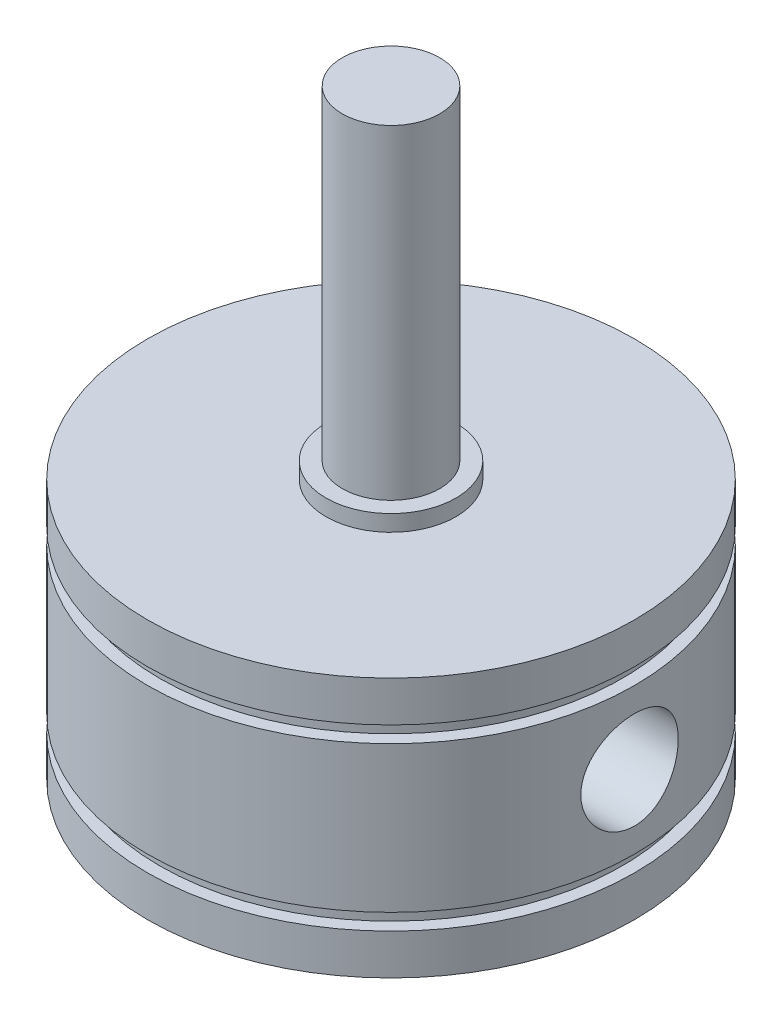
from build123d import *

# Parameters (mm, degrees)
ESBO_O4_R                = 3
FURO_PERPENDICULAR_DEPTH = 53.971690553
ESBO_O5_R                = 3


with BuildPart() as part:
    # Esbo_o2 → Revolu_o (revolve)
    with BuildSketch(Plane.XY, mode=Mode.PRIVATE) as revolu_o_sk:
        Polygon((0, 0), (0, 41), (3, 41), (3, 21), (4, 21), (4, 20), (15, 20), (15, 17.5), (14.25, 17.5), (14.25, 16.5), (15, 16.5), (15, 7.5), (14.25, 7.5), (14.25, 6.5), (15, 6.5), (15, 4), (4, 4), (4, 3), (3, 3), (3, 0), align=None)
    revolve(revolu_o_sk.sketch.rotate(Axis((0, 52.88343403, 0), (0, -1, 0)), 90), axis=Axis((0, 52.88343403, 0), (0, -1, 0)))

    # Esbo_o4 → Furo perpendicular (cut, through all)
    with BuildSketch(Plane.ZY.offset(15)):
        with Locations((0, 12)):
            Circle(ESBO_O4_R)
    extrude(amount=-FURO_PERPENDICULAR_DEPTH, mode=Mode.SUBTRACT)

    # Furo desviado a 25 graus: sweep along a path in Esbo_o7
    with BuildLine(Plane(origin=(0, 12, 0), x_dir=(1, 0, 0), z_dir=(0, 1, 0))) as furo_desviado_a_25_graus_path:
        Line((-13.594616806, -6.339273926), (0, 0))
    # Esbo_o5 → Furo desviado a 25 graus (sweep, cut)
    with BuildSketch(Plane(origin=(-13.594616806, 0, 6.339273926), x_dir=(0, 1, 0), z_dir=(-0.9063077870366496, 0, 0.4226182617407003))):
        with Locations((12, 0)):
            Circle(ESBO_O5_R)
    sweep(path=furo_desviado_a_25_graus_path.line, mode=Mode.SUBTRACT)


solid = part.part
